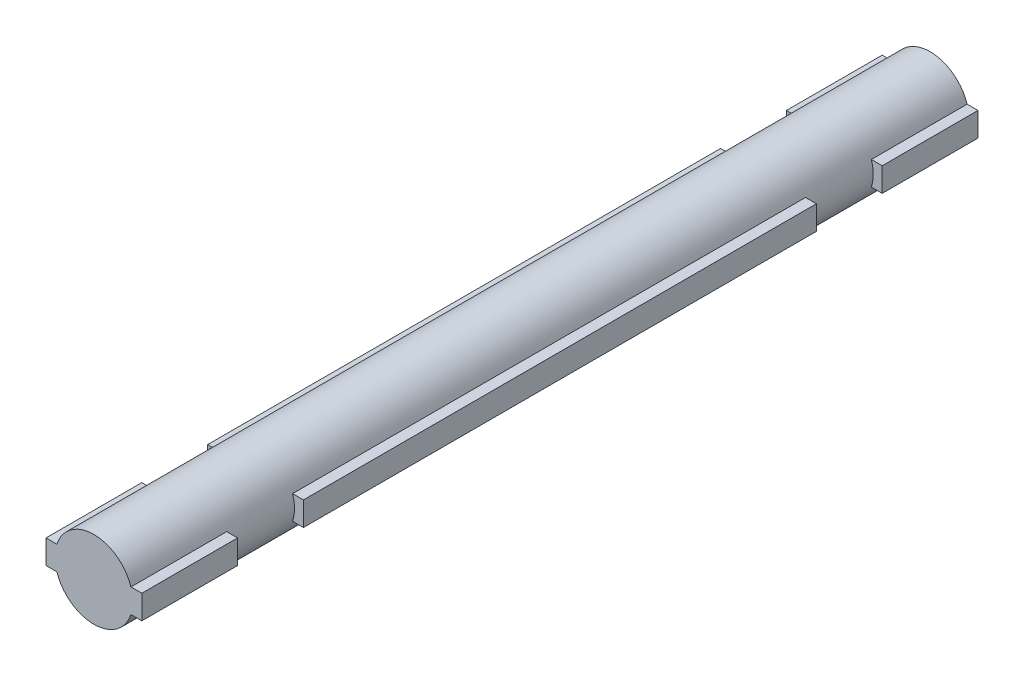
ISO-10303-21;
HEADER;
FILE_DESCRIPTION(('STEP AP214'),'2;1');
FILE_NAME('part.step','',(''),(''),'','','');
FILE_SCHEMA(('AUTOMOTIVE_DESIGN { 1 0 10303 214 1 1 1 1 }'));
ENDSEC;
DATA;
#1=APPLICATION_CONTEXT('core data for automotive mechanical design processes');
#2=APPLICATION_PROTOCOL_DEFINITION('international standard','automotive_design',2000,#1);
#3=PRODUCT_CONTEXT('',#1,'mechanical');
#4=PRODUCT('Part','Part','',(#3));
#5=PRODUCT_RELATED_PRODUCT_CATEGORY('part','',(#4));
#6=PRODUCT_DEFINITION_FORMATION('','',#4);
#7=PRODUCT_DEFINITION_CONTEXT('part definition',#1,'design');
#8=PRODUCT_DEFINITION('design','',#6,#7);
#9=PRODUCT_DEFINITION_SHAPE('','',#8);
#10=(LENGTH_UNIT() NAMED_UNIT(*) SI_UNIT(.MILLI.,.METRE.));
#11=(NAMED_UNIT(*) PLANE_ANGLE_UNIT() SI_UNIT($,.RADIAN.));
#12=(NAMED_UNIT(*) SI_UNIT($,.STERADIAN.) SOLID_ANGLE_UNIT());
#13=UNCERTAINTY_MEASURE_WITH_UNIT(LENGTH_MEASURE(1.E-05),#10,'distance_accuracy_value','');
#14=(GEOMETRIC_REPRESENTATION_CONTEXT(3) GLOBAL_UNCERTAINTY_ASSIGNED_CONTEXT((#13)) GLOBAL_UNIT_ASSIGNED_CONTEXT((#10,
#11,#12)) REPRESENTATION_CONTEXT('',''));
#15=CARTESIAN_POINT('',(0.,0.,0.));
#16=DIRECTION('',(0.,0.,1.));
#17=DIRECTION('',(1.,0.,0.));
#18=AXIS2_PLACEMENT_3D('',#15,#16,#17);
#19=CARTESIAN_POINT('',(2.4,-0.6,41.9));
#20=DIRECTION('',(-1.,0.,0.));
#21=DIRECTION('',(0.,0.,1.));
#22=AXIS2_PLACEMENT_3D('',#19,#20,#21);
#23=PLANE('',#22);
#24=DIRECTION('',(0.,-1.,0.));
#25=VECTOR('',#24,1.);
#26=CARTESIAN_POINT('',(2.4,-0.6,8.1));
#27=LINE('',#26,#25);
#28=CARTESIAN_POINT('',(2.4,0.6,8.1));
#29=VERTEX_POINT('',#28);
#30=CARTESIAN_POINT('',(2.4,-0.6,8.1));
#31=VERTEX_POINT('',#30);
#32=EDGE_CURVE('E335',#29,#31,#27,.T.);
#33=ORIENTED_EDGE('',*,*,#32,.F.);
#34=DIRECTION('',(0.,0.,-1.));
#35=VECTOR('',#34,1.);
#36=CARTESIAN_POINT('',(2.4,0.6,41.9));
#37=LINE('',#36,#35);
#38=CARTESIAN_POINT('',(2.4,0.6,33.8));
#39=VERTEX_POINT('',#38);
#40=EDGE_CURVE('E227',#39,#29,#37,.T.);
#41=ORIENTED_EDGE('',*,*,#40,.F.);
#42=DIRECTION('',(0.,1.,0.));
#43=VECTOR('',#42,1.);
#44=CARTESIAN_POINT('',(2.4,-0.6,33.8));
#45=LINE('',#44,#43);
#46=CARTESIAN_POINT('',(2.4,-0.6,33.8));
#47=VERTEX_POINT('',#46);
#48=EDGE_CURVE('E306',#47,#39,#45,.T.);
#49=ORIENTED_EDGE('',*,*,#48,.F.);
#50=DIRECTION('',(0.,0.,-1.));
#51=VECTOR('',#50,1.);
#52=CARTESIAN_POINT('',(2.4,-0.6,41.9));
#53=LINE('',#52,#51);
#54=EDGE_CURVE('E252',#47,#31,#53,.T.);
#55=ORIENTED_EDGE('',*,*,#54,.T.);
#56=EDGE_LOOP('',(#33,#41,#49,#55));
#57=FACE_BOUND('',#56,.T.);
#58=ADVANCED_FACE('F29',(#57),#23,.F.);
#59=CARTESIAN_POINT('',(2.4,0.6,41.9));
#60=DIRECTION('',(0.,-1.,0.));
#61=DIRECTION('',(0.,0.,-1.));
#62=AXIS2_PLACEMENT_3D('',#59,#60,#61);
#63=PLANE('',#62);
#64=DIRECTION('',(1.,0.,0.));
#65=VECTOR('',#64,1.);
#66=CARTESIAN_POINT('',(2.4,0.6,8.1));
#67=LINE('',#66,#65);
#68=CARTESIAN_POINT('',(1.85539753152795,0.6,8.1));
#69=VERTEX_POINT('',#68);
#70=EDGE_CURVE('E333',#69,#29,#67,.T.);
#71=ORIENTED_EDGE('',*,*,#70,.F.);
#72=DIRECTION('',(0.,0.,-1.));
#73=VECTOR('',#72,1.);
#74=CARTESIAN_POINT('',(1.85539753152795,0.6,41.9));
#75=LINE('',#74,#73);
#76=CARTESIAN_POINT('',(1.85539753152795,0.6,33.8));
#77=VERTEX_POINT('',#76);
#78=EDGE_CURVE('E213',#77,#69,#75,.T.);
#79=ORIENTED_EDGE('',*,*,#78,.F.);
#80=DIRECTION('',(-1.,0.,0.));
#81=VECTOR('',#80,1.);
#82=CARTESIAN_POINT('',(2.4,0.6,33.8));
#83=LINE('',#82,#81);
#84=EDGE_CURVE('E304',#39,#77,#83,.T.);
#85=ORIENTED_EDGE('',*,*,#84,.F.);
#86=ORIENTED_EDGE('',*,*,#40,.T.);
#87=EDGE_LOOP('',(#71,#79,#85,#86));
#88=FACE_BOUND('',#87,.T.);
#89=ADVANCED_FACE('F428',(#88),#63,.F.);
#90=CARTESIAN_POINT('',(-2.4,0.6,41.9));
#91=DIRECTION('',(0.,-1.,0.));
#92=DIRECTION('',(0.,0.,-1.));
#93=AXIS2_PLACEMENT_3D('',#90,#91,#92);
#94=PLANE('',#93);
#95=DIRECTION('',(1.,0.,0.));
#96=VECTOR('',#95,1.);
#97=CARTESIAN_POINT('',(-2.4,0.6,8.1));
#98=LINE('',#97,#96);
#99=CARTESIAN_POINT('',(-2.4,0.6,8.1));
#100=VERTEX_POINT('',#99);
#101=CARTESIAN_POINT('',(-1.85539753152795,0.6,8.1));
#102=VERTEX_POINT('',#101);
#103=EDGE_CURVE('E327',#100,#102,#98,.T.);
#104=ORIENTED_EDGE('',*,*,#103,.F.);
#105=DIRECTION('',(0.,0.,-1.));
#106=VECTOR('',#105,1.);
#107=CARTESIAN_POINT('',(-2.4,0.6,41.9));
#108=LINE('',#107,#106);
#109=CARTESIAN_POINT('',(-2.4,0.6,33.8));
#110=VERTEX_POINT('',#109);
#111=EDGE_CURVE('E383',#110,#100,#108,.T.);
#112=ORIENTED_EDGE('',*,*,#111,.F.);
#113=DIRECTION('',(-1.,0.,0.));
#114=VECTOR('',#113,1.);
#115=CARTESIAN_POINT('',(-2.4,0.6,33.8));
#116=LINE('',#115,#114);
#117=CARTESIAN_POINT('',(-1.85539753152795,0.6,33.8));
#118=VERTEX_POINT('',#117);
#119=EDGE_CURVE('E297',#118,#110,#116,.T.);
#120=ORIENTED_EDGE('',*,*,#119,.F.);
#121=DIRECTION('',(0.,0.,-1.));
#122=VECTOR('',#121,1.);
#123=CARTESIAN_POINT('',(-1.85539753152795,0.6,41.9));
#124=LINE('',#123,#122);
#125=EDGE_CURVE('E218',#118,#102,#124,.T.);
#126=ORIENTED_EDGE('',*,*,#125,.T.);
#127=EDGE_LOOP('',(#104,#112,#120,#126));
#128=FACE_BOUND('',#127,.T.);
#129=ADVANCED_FACE('F434',(#128),#94,.F.);
#130=CARTESIAN_POINT('',(-2.4,-0.6,41.9));
#131=DIRECTION('',(1.,0.,0.));
#132=DIRECTION('',(0.,0.,-1.));
#133=AXIS2_PLACEMENT_3D('',#130,#131,#132);
#134=PLANE('',#133);
#135=DIRECTION('',(0.,1.,0.));
#136=VECTOR('',#135,1.);
#137=CARTESIAN_POINT('',(-2.4,-0.6,8.1));
#138=LINE('',#137,#136);
#139=CARTESIAN_POINT('',(-2.4,-0.6,8.1));
#140=VERTEX_POINT('',#139);
#141=EDGE_CURVE('E329',#140,#100,#138,.T.);
#142=ORIENTED_EDGE('',*,*,#141,.F.);
#143=DIRECTION('',(0.,0.,-1.));
#144=VECTOR('',#143,1.);
#145=CARTESIAN_POINT('',(-2.4,-0.6,41.9));
#146=LINE('',#145,#144);
#147=CARTESIAN_POINT('',(-2.4,-0.6,33.8));
#148=VERTEX_POINT('',#147);
#149=EDGE_CURVE('E370',#148,#140,#146,.T.);
#150=ORIENTED_EDGE('',*,*,#149,.F.);
#151=DIRECTION('',(0.,-1.,0.));
#152=VECTOR('',#151,1.);
#153=CARTESIAN_POINT('',(-2.4,-0.6,33.8));
#154=LINE('',#153,#152);
#155=EDGE_CURVE('E299',#110,#148,#154,.T.);
#156=ORIENTED_EDGE('',*,*,#155,.F.);
#157=ORIENTED_EDGE('',*,*,#111,.T.);
#158=EDGE_LOOP('',(#142,#150,#156,#157));
#159=FACE_BOUND('',#158,.T.);
#160=ADVANCED_FACE('F456',(#159),#134,.F.);
#161=CARTESIAN_POINT('',(-2.4,-0.6,41.9));
#162=DIRECTION('',(0.,1.,0.));
#163=DIRECTION('',(0.,0.,1.));
#164=AXIS2_PLACEMENT_3D('',#161,#162,#163);
#165=PLANE('',#164);
#166=DIRECTION('',(-1.,0.,0.));
#167=VECTOR('',#166,1.);
#168=CARTESIAN_POINT('',(-2.4,-0.6,8.1));
#169=LINE('',#168,#167);
#170=CARTESIAN_POINT('',(-1.85539753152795,-0.6,8.1));
#171=VERTEX_POINT('',#170);
#172=EDGE_CURVE('E331',#171,#140,#169,.T.);
#173=ORIENTED_EDGE('',*,*,#172,.F.);
#174=DIRECTION('',(0.,0.,-1.));
#175=VECTOR('',#174,1.);
#176=CARTESIAN_POINT('',(-1.85539753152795,-0.6,41.9));
#177=LINE('',#176,#175);
#178=CARTESIAN_POINT('',(-1.85539753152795,-0.6,33.8));
#179=VERTEX_POINT('',#178);
#180=EDGE_CURVE('E368',#179,#171,#177,.T.);
#181=ORIENTED_EDGE('',*,*,#180,.F.);
#182=DIRECTION('',(1.,0.,0.));
#183=VECTOR('',#182,1.);
#184=CARTESIAN_POINT('',(-2.4,-0.6,33.8));
#185=LINE('',#184,#183);
#186=EDGE_CURVE('E301',#148,#179,#185,.T.);
#187=ORIENTED_EDGE('',*,*,#186,.F.);
#188=ORIENTED_EDGE('',*,*,#149,.T.);
#189=EDGE_LOOP('',(#173,#181,#187,#188));
#190=FACE_BOUND('',#189,.T.);
#191=ADVANCED_FACE('F366',(#190),#165,.F.);
#192=CARTESIAN_POINT('',(2.4,-0.6,41.9));
#193=DIRECTION('',(0.,1.,0.));
#194=DIRECTION('',(0.,0.,1.));
#195=AXIS2_PLACEMENT_3D('',#192,#193,#194);
#196=PLANE('',#195);
#197=DIRECTION('',(-1.,0.,0.));
#198=VECTOR('',#197,1.);
#199=CARTESIAN_POINT('',(2.4,-0.6,8.1));
#200=LINE('',#199,#198);
#201=CARTESIAN_POINT('',(1.85539753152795,-0.6,8.1));
#202=VERTEX_POINT('',#201);
#203=EDGE_CURVE('E337',#31,#202,#200,.T.);
#204=ORIENTED_EDGE('',*,*,#203,.F.);
#205=ORIENTED_EDGE('',*,*,#54,.F.);
#206=DIRECTION('',(1.,0.,0.));
#207=VECTOR('',#206,1.);
#208=CARTESIAN_POINT('',(2.4,-0.6,33.8));
#209=LINE('',#208,#207);
#210=CARTESIAN_POINT('',(1.85539753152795,-0.6,33.8));
#211=VERTEX_POINT('',#210);
#212=EDGE_CURVE('E12',#211,#47,#209,.T.);
#213=ORIENTED_EDGE('',*,*,#212,.F.);
#214=DIRECTION('',(0.,0.,-1.));
#215=VECTOR('',#214,1.);
#216=CARTESIAN_POINT('',(1.85539753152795,-0.6,41.9));
#217=LINE('',#216,#215);
#218=EDGE_CURVE('E255',#211,#202,#217,.T.);
#219=ORIENTED_EDGE('',*,*,#218,.T.);
#220=EDGE_LOOP('',(#204,#205,#213,#219));
#221=FACE_BOUND('',#220,.T.);
#222=ADVANCED_FACE('F412',(#221),#196,.F.);
#223=CARTESIAN_POINT('',(2.4,0.6,4.8));
#224=VERTEX_POINT('',#223);
#225=CARTESIAN_POINT('',(2.4,0.6,0.));
#226=VERTEX_POINT('',#225);
#227=EDGE_CURVE('E223',#224,#226,#37,.T.);
#228=ORIENTED_EDGE('',*,*,#227,.F.);
#229=DIRECTION('',(0.,-1.,0.));
#230=VECTOR('',#229,1.);
#231=CARTESIAN_POINT('',(2.4,-0.6,4.8));
#232=LINE('',#231,#230);
#233=CARTESIAN_POINT('',(2.4,-0.6,4.8));
#234=VERTEX_POINT('',#233);
#235=EDGE_CURVE('E195',#224,#234,#232,.T.);
#236=ORIENTED_EDGE('',*,*,#235,.T.);
#237=CARTESIAN_POINT('',(2.4,-0.6,0.));
#238=VERTEX_POINT('',#237);
#239=EDGE_CURVE('E254',#234,#238,#53,.T.);
#240=ORIENTED_EDGE('',*,*,#239,.T.);
#241=DIRECTION('',(0.,1.,0.));
#242=VECTOR('',#241,1.);
#243=CARTESIAN_POINT('',(2.4,-0.6,0.));
#244=LINE('',#243,#242);
#245=EDGE_CURVE('E295',#238,#226,#244,.T.);
#246=ORIENTED_EDGE('',*,*,#245,.T.);
#247=EDGE_LOOP('',(#228,#236,#240,#246));
#248=FACE_BOUND('',#247,.T.);
#249=ADVANCED_FACE('F407',(#248),#23,.F.);
#250=CARTESIAN_POINT('',(1.85539753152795,0.6,4.8));
#251=VERTEX_POINT('',#250);
#252=CARTESIAN_POINT('',(1.85539753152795,0.6,0.));
#253=VERTEX_POINT('',#252);
#254=EDGE_CURVE('E204',#251,#253,#75,.T.);
#255=ORIENTED_EDGE('',*,*,#254,.F.);
#256=DIRECTION('',(1.,0.,0.));
#257=VECTOR('',#256,1.);
#258=CARTESIAN_POINT('',(2.4,0.6,4.8));
#259=LINE('',#258,#257);
#260=EDGE_CURVE('E189',#251,#224,#259,.T.);
#261=ORIENTED_EDGE('',*,*,#260,.T.);
#262=ORIENTED_EDGE('',*,*,#227,.T.);
#263=DIRECTION('',(-1.,0.,0.));
#264=VECTOR('',#263,1.);
#265=CARTESIAN_POINT('',(2.4,0.6,0.));
#266=LINE('',#265,#264);
#267=EDGE_CURVE('E211',#226,#253,#266,.T.);
#268=ORIENTED_EDGE('',*,*,#267,.T.);
#269=EDGE_LOOP('',(#255,#261,#262,#268));
#270=FACE_BOUND('',#269,.T.);
#271=ADVANCED_FACE('F209',(#270),#63,.F.);
#272=CARTESIAN_POINT('',(-2.4,0.6,4.8));
#273=VERTEX_POINT('',#272);
#274=CARTESIAN_POINT('',(-2.4,0.6,0.));
#275=VERTEX_POINT('',#274);
#276=EDGE_CURVE('E380',#273,#275,#108,.T.);
#277=ORIENTED_EDGE('',*,*,#276,.F.);
#278=DIRECTION('',(1.,0.,0.));
#279=VECTOR('',#278,1.);
#280=CARTESIAN_POINT('',(-2.4,0.6,4.8));
#281=LINE('',#280,#279);
#282=CARTESIAN_POINT('',(-1.85539753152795,0.6,4.8));
#283=VERTEX_POINT('',#282);
#284=EDGE_CURVE('E339',#273,#283,#281,.T.);
#285=ORIENTED_EDGE('',*,*,#284,.T.);
#286=CARTESIAN_POINT('',(-1.85539753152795,0.6,0.));
#287=VERTEX_POINT('',#286);
#288=EDGE_CURVE('E220',#283,#287,#124,.T.);
#289=ORIENTED_EDGE('',*,*,#288,.T.);
#290=DIRECTION('',(-1.,0.,0.));
#291=VECTOR('',#290,1.);
#292=CARTESIAN_POINT('',(-2.4,0.6,0.));
#293=LINE('',#292,#291);
#294=EDGE_CURVE('E289',#287,#275,#293,.T.);
#295=ORIENTED_EDGE('',*,*,#294,.T.);
#296=EDGE_LOOP('',(#277,#285,#289,#295));
#297=FACE_BOUND('',#296,.T.);
#298=ADVANCED_FACE('F396',(#297),#94,.F.);
#299=CARTESIAN_POINT('',(-2.4,-0.6,4.8));
#300=VERTEX_POINT('',#299);
#301=CARTESIAN_POINT('',(-2.4,-0.6,0.));
#302=VERTEX_POINT('',#301);
#303=EDGE_CURVE('E375',#300,#302,#146,.T.);
#304=ORIENTED_EDGE('',*,*,#303,.F.);
#305=DIRECTION('',(0.,1.,0.));
#306=VECTOR('',#305,1.);
#307=CARTESIAN_POINT('',(-2.4,-0.6,4.8));
#308=LINE('',#307,#306);
#309=EDGE_CURVE('E342',#300,#273,#308,.T.);
#310=ORIENTED_EDGE('',*,*,#309,.T.);
#311=ORIENTED_EDGE('',*,*,#276,.T.);
#312=DIRECTION('',(0.,-1.,0.));
#313=VECTOR('',#312,1.);
#314=CARTESIAN_POINT('',(-2.4,-0.6,0.));
#315=LINE('',#314,#313);
#316=EDGE_CURVE('E286',#275,#302,#315,.T.);
#317=ORIENTED_EDGE('',*,*,#316,.T.);
#318=EDGE_LOOP('',(#304,#310,#311,#317));
#319=FACE_BOUND('',#318,.T.);
#320=ADVANCED_FACE('F391',(#319),#134,.F.);
#321=CARTESIAN_POINT('',(-1.85539753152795,-0.6,4.8));
#322=VERTEX_POINT('',#321);
#323=CARTESIAN_POINT('',(-1.85539753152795,-0.6,0.));
#324=VERTEX_POINT('',#323);
#325=EDGE_CURVE('E372',#322,#324,#177,.T.);
#326=ORIENTED_EDGE('',*,*,#325,.F.);
#327=DIRECTION('',(-1.,0.,0.));
#328=VECTOR('',#327,1.);
#329=CARTESIAN_POINT('',(-2.4,-0.6,4.8));
#330=LINE('',#329,#328);
#331=EDGE_CURVE('E199',#322,#300,#330,.T.);
#332=ORIENTED_EDGE('',*,*,#331,.T.);
#333=ORIENTED_EDGE('',*,*,#303,.T.);
#334=DIRECTION('',(1.,0.,0.));
#335=VECTOR('',#334,1.);
#336=CARTESIAN_POINT('',(-2.4,-0.6,0.));
#337=LINE('',#336,#335);
#338=EDGE_CURVE('E283',#302,#324,#337,.T.);
#339=ORIENTED_EDGE('',*,*,#338,.T.);
#340=EDGE_LOOP('',(#326,#332,#333,#339));
#341=FACE_BOUND('',#340,.T.);
#342=ADVANCED_FACE('F404',(#341),#165,.F.);
#343=ORIENTED_EDGE('',*,*,#239,.F.);
#344=DIRECTION('',(-1.,0.,0.));
#345=VECTOR('',#344,1.);
#346=CARTESIAN_POINT('',(2.4,-0.6,4.8));
#347=LINE('',#346,#345);
#348=CARTESIAN_POINT('',(1.85539753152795,-0.6,4.8));
#349=VERTEX_POINT('',#348);
#350=EDGE_CURVE('E348',#234,#349,#347,.T.);
#351=ORIENTED_EDGE('',*,*,#350,.T.);
#352=CARTESIAN_POINT('',(1.85539753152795,-0.6,0.));
#353=VERTEX_POINT('',#352);
#354=EDGE_CURVE('E207',#349,#353,#217,.T.);
#355=ORIENTED_EDGE('',*,*,#354,.T.);
#356=DIRECTION('',(1.,0.,0.));
#357=VECTOR('',#356,1.);
#358=CARTESIAN_POINT('',(2.4,-0.6,0.));
#359=LINE('',#358,#357);
#360=EDGE_CURVE('E279',#353,#238,#359,.T.);
#361=ORIENTED_EDGE('',*,*,#360,.T.);
#362=EDGE_LOOP('',(#343,#351,#355,#361));
#363=FACE_BOUND('',#362,.T.);
#364=ADVANCED_FACE('F409',(#363),#196,.F.);
#365=CARTESIAN_POINT('',(2.4,-0.6,41.9));
#366=VERTEX_POINT('',#365);
#367=CARTESIAN_POINT('',(2.4,-0.6,37.1));
#368=VERTEX_POINT('',#367);
#369=EDGE_CURVE('E242',#366,#368,#53,.T.);
#370=ORIENTED_EDGE('',*,*,#369,.T.);
#371=DIRECTION('',(0.,1.,0.));
#372=VECTOR('',#371,1.);
#373=CARTESIAN_POINT('',(2.4,-0.6,37.1));
#374=LINE('',#373,#372);
#375=CARTESIAN_POINT('',(2.4,0.6,37.1));
#376=VERTEX_POINT('',#375);
#377=EDGE_CURVE('E249',#368,#376,#374,.T.);
#378=ORIENTED_EDGE('',*,*,#377,.T.);
#379=CARTESIAN_POINT('',(2.4,0.6,41.9));
#380=VERTEX_POINT('',#379);
#381=EDGE_CURVE('E228',#380,#376,#37,.T.);
#382=ORIENTED_EDGE('',*,*,#381,.F.);
#383=DIRECTION('',(0.,1.,0.));
#384=VECTOR('',#383,1.);
#385=CARTESIAN_POINT('',(2.4,-0.6,41.9));
#386=LINE('',#385,#384);
#387=EDGE_CURVE('E251',#366,#380,#386,.T.);
#388=ORIENTED_EDGE('',*,*,#387,.F.);
#389=EDGE_LOOP('',(#370,#378,#382,#388));
#390=FACE_BOUND('',#389,.T.);
#391=ADVANCED_FACE('F31',(#390),#23,.F.);
#392=ORIENTED_EDGE('',*,*,#381,.T.);
#393=DIRECTION('',(-1.,0.,0.));
#394=VECTOR('',#393,1.);
#395=CARTESIAN_POINT('',(2.4,0.6,37.1));
#396=LINE('',#395,#394);
#397=CARTESIAN_POINT('',(1.85539753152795,0.6,37.1));
#398=VERTEX_POINT('',#397);
#399=EDGE_CURVE('E317',#376,#398,#396,.T.);
#400=ORIENTED_EDGE('',*,*,#399,.T.);
#401=CARTESIAN_POINT('',(1.85539753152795,0.6,41.9));
#402=VERTEX_POINT('',#401);
#403=EDGE_CURVE('E216',#402,#398,#75,.T.);
#404=ORIENTED_EDGE('',*,*,#403,.F.);
#405=DIRECTION('',(-1.,0.,0.));
#406=VECTOR('',#405,1.);
#407=CARTESIAN_POINT('',(2.4,0.6,41.9));
#408=LINE('',#407,#406);
#409=EDGE_CURVE('E276',#380,#402,#408,.T.);
#410=ORIENTED_EDGE('',*,*,#409,.F.);
#411=EDGE_LOOP('',(#392,#400,#404,#410));
#412=FACE_BOUND('',#411,.T.);
#413=ADVANCED_FACE('F418',(#412),#63,.F.);
#414=CARTESIAN_POINT('',(-1.85539753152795,0.6,41.9));
#415=VERTEX_POINT('',#414);
#416=CARTESIAN_POINT('',(-1.85539753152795,0.6,37.1));
#417=VERTEX_POINT('',#416);
#418=EDGE_CURVE('E214',#415,#417,#124,.T.);
#419=ORIENTED_EDGE('',*,*,#418,.T.);
#420=DIRECTION('',(-1.,0.,0.));
#421=VECTOR('',#420,1.);
#422=CARTESIAN_POINT('',(-2.4,0.6,37.1));
#423=LINE('',#422,#421);
#424=CARTESIAN_POINT('',(-2.4,0.6,37.1));
#425=VERTEX_POINT('',#424);
#426=EDGE_CURVE('E308',#417,#425,#423,.T.);
#427=ORIENTED_EDGE('',*,*,#426,.T.);
#428=CARTESIAN_POINT('',(-2.4,0.6,41.9));
#429=VERTEX_POINT('',#428);
#430=EDGE_CURVE('E381',#429,#425,#108,.T.);
#431=ORIENTED_EDGE('',*,*,#430,.F.);
#432=DIRECTION('',(-1.,0.,0.));
#433=VECTOR('',#432,1.);
#434=CARTESIAN_POINT('',(-2.4,0.6,41.9));
#435=LINE('',#434,#433);
#436=EDGE_CURVE('E272',#415,#429,#435,.T.);
#437=ORIENTED_EDGE('',*,*,#436,.F.);
#438=EDGE_LOOP('',(#419,#427,#431,#437));
#439=FACE_BOUND('',#438,.T.);
#440=ADVANCED_FACE('F445',(#439),#94,.F.);
#441=ORIENTED_EDGE('',*,*,#430,.T.);
#442=DIRECTION('',(0.,-1.,0.));
#443=VECTOR('',#442,1.);
#444=CARTESIAN_POINT('',(-2.4,-0.6,37.1));
#445=LINE('',#444,#443);
#446=CARTESIAN_POINT('',(-2.4,-0.6,37.1));
#447=VERTEX_POINT('',#446);
#448=EDGE_CURVE('E311',#425,#447,#445,.T.);
#449=ORIENTED_EDGE('',*,*,#448,.T.);
#450=CARTESIAN_POINT('',(-2.4,-0.6,41.9));
#451=VERTEX_POINT('',#450);
#452=EDGE_CURVE('E377',#451,#447,#146,.T.);
#453=ORIENTED_EDGE('',*,*,#452,.F.);
#454=DIRECTION('',(0.,-1.,0.));
#455=VECTOR('',#454,1.);
#456=CARTESIAN_POINT('',(-2.4,-0.6,41.9));
#457=LINE('',#456,#455);
#458=EDGE_CURVE('E270',#429,#451,#457,.T.);
#459=ORIENTED_EDGE('',*,*,#458,.F.);
#460=EDGE_LOOP('',(#441,#449,#453,#459));
#461=FACE_BOUND('',#460,.T.);
#462=ADVANCED_FACE('F450',(#461),#134,.F.);
#463=ORIENTED_EDGE('',*,*,#452,.T.);
#464=DIRECTION('',(1.,0.,0.));
#465=VECTOR('',#464,1.);
#466=CARTESIAN_POINT('',(-2.4,-0.6,37.1));
#467=LINE('',#466,#465);
#468=CARTESIAN_POINT('',(-1.85539753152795,-0.6,37.1));
#469=VERTEX_POINT('',#468);
#470=EDGE_CURVE('E314',#447,#469,#467,.T.);
#471=ORIENTED_EDGE('',*,*,#470,.T.);
#472=CARTESIAN_POINT('',(-1.85539753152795,-0.6,41.9));
#473=VERTEX_POINT('',#472);
#474=EDGE_CURVE('E371',#473,#469,#177,.T.);
#475=ORIENTED_EDGE('',*,*,#474,.F.);
#476=DIRECTION('',(1.,0.,0.));
#477=VECTOR('',#476,1.);
#478=CARTESIAN_POINT('',(-2.4,-0.6,41.9));
#479=LINE('',#478,#477);
#480=EDGE_CURVE('E266',#451,#473,#479,.T.);
#481=ORIENTED_EDGE('',*,*,#480,.F.);
#482=EDGE_LOOP('',(#463,#471,#475,#481));
#483=FACE_BOUND('',#482,.T.);
#484=ADVANCED_FACE('F420',(#483),#165,.F.);
#485=CARTESIAN_POINT('',(0.,0.,41.9));
#486=DIRECTION('',(0.,0.,-1.));
#487=DIRECTION('',(-1.,0.,0.));
#488=AXIS2_PLACEMENT_3D('',#485,#486,#487);
#489=CYLINDRICAL_SURFACE('',#488,1.95);
#490=CARTESIAN_POINT('',(0.,0.,4.8));
#491=DIRECTION('',(0.,0.,1.));
#492=DIRECTION('',(1.,0.,0.));
#493=AXIS2_PLACEMENT_3D('',#490,#491,#492);
#494=CIRCLE('',#493,1.95);
#495=EDGE_CURVE('E192',#349,#251,#494,.T.);
#496=ORIENTED_EDGE('',*,*,#495,.T.);
#497=ORIENTED_EDGE('',*,*,#254,.T.);
#498=CARTESIAN_POINT('',(0.,0.,0.));
#499=DIRECTION('',(0.,0.,1.));
#500=DIRECTION('',(1.,0.,0.));
#501=AXIS2_PLACEMENT_3D('',#498,#499,#500);
#502=CIRCLE('',#501,1.95);
#503=EDGE_CURVE('E292',#253,#287,#502,.T.);
#504=ORIENTED_EDGE('',*,*,#503,.T.);
#505=ORIENTED_EDGE('',*,*,#288,.F.);
#506=EDGE_CURVE('E52',#283,#322,#494,.T.);
#507=ORIENTED_EDGE('',*,*,#506,.T.);
#508=ORIENTED_EDGE('',*,*,#325,.T.);
#509=CARTESIAN_POINT('',(0.,0.,0.));
#510=DIRECTION('',(0.,0.,1.));
#511=DIRECTION('',(1.,0.,0.));
#512=AXIS2_PLACEMENT_3D('',#509,#510,#511);
#513=CIRCLE('',#512,1.95);
#514=EDGE_CURVE('E281',#324,#353,#513,.T.);
#515=ORIENTED_EDGE('',*,*,#514,.T.);
#516=ORIENTED_EDGE('',*,*,#354,.F.);
#517=EDGE_LOOP('',(#496,#497,#504,#505,#507,#508,#515,#516));
#518=FACE_BOUND('',#517,.T.);
#519=ORIENTED_EDGE('',*,*,#78,.T.);
#520=CARTESIAN_POINT('',(0.,0.,8.1));
#521=DIRECTION('',(0.,0.,1.));
#522=DIRECTION('',(1.,0.,0.));
#523=AXIS2_PLACEMENT_3D('',#520,#521,#522);
#524=CIRCLE('',#523,1.95);
#525=EDGE_CURVE('E44',#202,#69,#524,.T.);
#526=ORIENTED_EDGE('',*,*,#525,.F.);
#527=ORIENTED_EDGE('',*,*,#218,.F.);
#528=CARTESIAN_POINT('',(0.,0.,33.8));
#529=DIRECTION('',(0.,0.,1.));
#530=DIRECTION('',(1.,0.,0.));
#531=AXIS2_PLACEMENT_3D('',#528,#529,#530);
#532=CIRCLE('',#531,1.95);
#533=EDGE_CURVE('E321',#211,#77,#532,.T.);
#534=ORIENTED_EDGE('',*,*,#533,.T.);
#535=EDGE_LOOP('',(#519,#526,#527,#534));
#536=FACE_BOUND('',#535,.T.);
#537=EDGE_CURVE('E350',#102,#171,#524,.T.);
#538=ORIENTED_EDGE('',*,*,#537,.F.);
#539=ORIENTED_EDGE('',*,*,#125,.F.);
#540=EDGE_CURVE('E320',#118,#179,#532,.T.);
#541=ORIENTED_EDGE('',*,*,#540,.T.);
#542=ORIENTED_EDGE('',*,*,#180,.T.);
#543=EDGE_LOOP('',(#538,#539,#541,#542));
#544=FACE_BOUND('',#543,.T.);
#545=ORIENTED_EDGE('',*,*,#403,.T.);
#546=CARTESIAN_POINT('',(0.,0.,37.1));
#547=DIRECTION('',(0.,0.,1.));
#548=DIRECTION('',(1.,0.,0.));
#549=AXIS2_PLACEMENT_3D('',#546,#547,#548);
#550=CIRCLE('',#549,1.95);
#551=CARTESIAN_POINT('',(1.85539753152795,-0.6,37.1));
#552=VERTEX_POINT('',#551);
#553=EDGE_CURVE('E325',#552,#398,#550,.T.);
#554=ORIENTED_EDGE('',*,*,#553,.F.);
#555=CARTESIAN_POINT('',(1.85539753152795,-0.6,41.9));
#556=VERTEX_POINT('',#555);
#557=EDGE_CURVE('E245',#556,#552,#217,.T.);
#558=ORIENTED_EDGE('',*,*,#557,.F.);
#559=CARTESIAN_POINT('',(0.,0.,41.9));
#560=DIRECTION('',(0.,0.,1.));
#561=DIRECTION('',(1.,0.,0.));
#562=AXIS2_PLACEMENT_3D('',#559,#560,#561);
#563=CIRCLE('',#562,1.95);
#564=EDGE_CURVE('E264',#473,#556,#563,.T.);
#565=ORIENTED_EDGE('',*,*,#564,.F.);
#566=ORIENTED_EDGE('',*,*,#474,.T.);
#567=EDGE_CURVE('E324',#417,#469,#550,.T.);
#568=ORIENTED_EDGE('',*,*,#567,.F.);
#569=ORIENTED_EDGE('',*,*,#418,.F.);
#570=CARTESIAN_POINT('',(0.,0.,41.9));
#571=DIRECTION('',(0.,0.,1.));
#572=DIRECTION('',(1.,0.,0.));
#573=AXIS2_PLACEMENT_3D('',#570,#571,#572);
#574=CIRCLE('',#573,1.95);
#575=EDGE_CURVE('E274',#402,#415,#574,.T.);
#576=ORIENTED_EDGE('',*,*,#575,.F.);
#577=EDGE_LOOP('',(#545,#554,#558,#565,#566,#568,#569,#576));
#578=FACE_BOUND('',#577,.T.);
#579=ADVANCED_FACE('F202',(#518,#536,#544,#578),#489,.T.);
#580=ORIENTED_EDGE('',*,*,#557,.T.);
#581=DIRECTION('',(1.,0.,0.));
#582=VECTOR('',#581,1.);
#583=CARTESIAN_POINT('',(2.4,-0.6,37.1));
#584=LINE('',#583,#582);
#585=EDGE_CURVE('E37',#552,#368,#584,.T.);
#586=ORIENTED_EDGE('',*,*,#585,.T.);
#587=ORIENTED_EDGE('',*,*,#369,.F.);
#588=DIRECTION('',(1.,0.,0.));
#589=VECTOR('',#588,1.);
#590=CARTESIAN_POINT('',(2.4,-0.6,41.9));
#591=LINE('',#590,#589);
#592=EDGE_CURVE('E259',#556,#366,#591,.T.);
#593=ORIENTED_EDGE('',*,*,#592,.F.);
#594=EDGE_LOOP('',(#580,#586,#587,#593));
#595=FACE_BOUND('',#594,.T.);
#596=ADVANCED_FACE('F240',(#595),#196,.F.);
#597=CARTESIAN_POINT('',(0.,0.,41.9));
#598=DIRECTION('',(0.,0.,1.));
#599=DIRECTION('',(1.,0.,0.));
#600=AXIS2_PLACEMENT_3D('',#597,#598,#599);
#601=PLANE('',#600);
#602=ORIENTED_EDGE('',*,*,#387,.T.);
#603=ORIENTED_EDGE('',*,*,#409,.T.);
#604=ORIENTED_EDGE('',*,*,#575,.T.);
#605=ORIENTED_EDGE('',*,*,#436,.T.);
#606=ORIENTED_EDGE('',*,*,#458,.T.);
#607=ORIENTED_EDGE('',*,*,#480,.T.);
#608=ORIENTED_EDGE('',*,*,#564,.T.);
#609=ORIENTED_EDGE('',*,*,#592,.T.);
#610=EDGE_LOOP('',(#602,#603,#604,#605,#606,#607,#608,#609));
#611=FACE_BOUND('',#610,.T.);
#612=ADVANCED_FACE('F424',(#611),#601,.T.);
#613=CARTESIAN_POINT('',(0.,0.,0.));
#614=DIRECTION('',(0.,0.,1.));
#615=DIRECTION('',(1.,0.,0.));
#616=AXIS2_PLACEMENT_3D('',#613,#614,#615);
#617=PLANE('',#616);
#618=ORIENTED_EDGE('',*,*,#245,.F.);
#619=ORIENTED_EDGE('',*,*,#360,.F.);
#620=ORIENTED_EDGE('',*,*,#514,.F.);
#621=ORIENTED_EDGE('',*,*,#338,.F.);
#622=ORIENTED_EDGE('',*,*,#316,.F.);
#623=ORIENTED_EDGE('',*,*,#294,.F.);
#624=ORIENTED_EDGE('',*,*,#503,.F.);
#625=ORIENTED_EDGE('',*,*,#267,.F.);
#626=EDGE_LOOP('',(#618,#619,#620,#621,#622,#623,#624,#625));
#627=FACE_BOUND('',#626,.T.);
#628=ADVANCED_FACE('F399',(#627),#617,.F.);
#629=CARTESIAN_POINT('',(0.,0.,37.1));
#630=DIRECTION('',(0.,0.,1.));
#631=DIRECTION('',(1.,0.,0.));
#632=AXIS2_PLACEMENT_3D('',#629,#630,#631);
#633=PLANE('',#632);
#634=ORIENTED_EDGE('',*,*,#377,.F.);
#635=ORIENTED_EDGE('',*,*,#585,.F.);
#636=ORIENTED_EDGE('',*,*,#553,.T.);
#637=ORIENTED_EDGE('',*,*,#399,.F.);
#638=EDGE_LOOP('',(#634,#635,#636,#637));
#639=FACE_BOUND('',#638,.T.);
#640=ADVANCED_FACE('F477',(#639),#633,.F.);
#641=CARTESIAN_POINT('',(0.,0.,33.8));
#642=DIRECTION('',(0.,0.,1.));
#643=DIRECTION('',(1.,0.,0.));
#644=AXIS2_PLACEMENT_3D('',#641,#642,#643);
#645=PLANE('',#644);
#646=ORIENTED_EDGE('',*,*,#84,.T.);
#647=ORIENTED_EDGE('',*,*,#533,.F.);
#648=ORIENTED_EDGE('',*,*,#212,.T.);
#649=ORIENTED_EDGE('',*,*,#48,.T.);
#650=EDGE_LOOP('',(#646,#647,#648,#649));
#651=FACE_BOUND('',#650,.T.);
#652=ADVANCED_FACE('F470',(#651),#645,.T.);
#653=ORIENTED_EDGE('',*,*,#119,.T.);
#654=ORIENTED_EDGE('',*,*,#155,.T.);
#655=ORIENTED_EDGE('',*,*,#186,.T.);
#656=ORIENTED_EDGE('',*,*,#540,.F.);
#657=EDGE_LOOP('',(#653,#654,#655,#656));
#658=FACE_BOUND('',#657,.T.);
#659=ADVANCED_FACE('F467',(#658),#645,.T.);
#660=ORIENTED_EDGE('',*,*,#567,.T.);
#661=ORIENTED_EDGE('',*,*,#470,.F.);
#662=ORIENTED_EDGE('',*,*,#448,.F.);
#663=ORIENTED_EDGE('',*,*,#426,.F.);
#664=EDGE_LOOP('',(#660,#661,#662,#663));
#665=FACE_BOUND('',#664,.T.);
#666=ADVANCED_FACE('F469',(#665),#633,.F.);
#667=CARTESIAN_POINT('',(0.,0.,4.8));
#668=DIRECTION('',(0.,0.,-1.));
#669=DIRECTION('',(-1.,0.,0.));
#670=AXIS2_PLACEMENT_3D('',#667,#668,#669);
#671=PLANE('',#670);
#672=ORIENTED_EDGE('',*,*,#495,.F.);
#673=ORIENTED_EDGE('',*,*,#350,.F.);
#674=ORIENTED_EDGE('',*,*,#235,.F.);
#675=ORIENTED_EDGE('',*,*,#260,.F.);
#676=EDGE_LOOP('',(#672,#673,#674,#675));
#677=FACE_BOUND('',#676,.T.);
#678=ADVANCED_FACE('F191',(#677),#671,.F.);
#679=CARTESIAN_POINT('',(0.,0.,8.1));
#680=DIRECTION('',(0.,0.,-1.));
#681=DIRECTION('',(-1.,0.,0.));
#682=AXIS2_PLACEMENT_3D('',#679,#680,#681);
#683=PLANE('',#682);
#684=ORIENTED_EDGE('',*,*,#70,.T.);
#685=ORIENTED_EDGE('',*,*,#32,.T.);
#686=ORIENTED_EDGE('',*,*,#203,.T.);
#687=ORIENTED_EDGE('',*,*,#525,.T.);
#688=EDGE_LOOP('',(#684,#685,#686,#687));
#689=FACE_BOUND('',#688,.T.);
#690=ADVANCED_FACE('F500',(#689),#683,.T.);
#691=ORIENTED_EDGE('',*,*,#103,.T.);
#692=ORIENTED_EDGE('',*,*,#537,.T.);
#693=ORIENTED_EDGE('',*,*,#172,.T.);
#694=ORIENTED_EDGE('',*,*,#141,.T.);
#695=EDGE_LOOP('',(#691,#692,#693,#694));
#696=FACE_BOUND('',#695,.T.);
#697=ADVANCED_FACE('F356',(#696),#683,.T.);
#698=ORIENTED_EDGE('',*,*,#309,.F.);
#699=ORIENTED_EDGE('',*,*,#331,.F.);
#700=ORIENTED_EDGE('',*,*,#506,.F.);
#701=ORIENTED_EDGE('',*,*,#284,.F.);
#702=EDGE_LOOP('',(#698,#699,#700,#701));
#703=FACE_BOUND('',#702,.T.);
#704=ADVANCED_FACE('F406',(#703),#671,.F.);
#705=CLOSED_SHELL('',(#58,#89,#129,#160,#191,#222,#249,#271,#298,#320,#342,#364,#391,#413,#440,
#462,#484,#579,#596,#612,#628,#640,#652,#659,#666,#678,#690,#697,#704));
#706=MANIFOLD_SOLID_BREP('B2',#705);
#707=ADVANCED_BREP_SHAPE_REPRESENTATION('',(#18,#706),#14);
#708=SHAPE_DEFINITION_REPRESENTATION(#9,#707);
ENDSEC;
END-ISO-10303-21;
